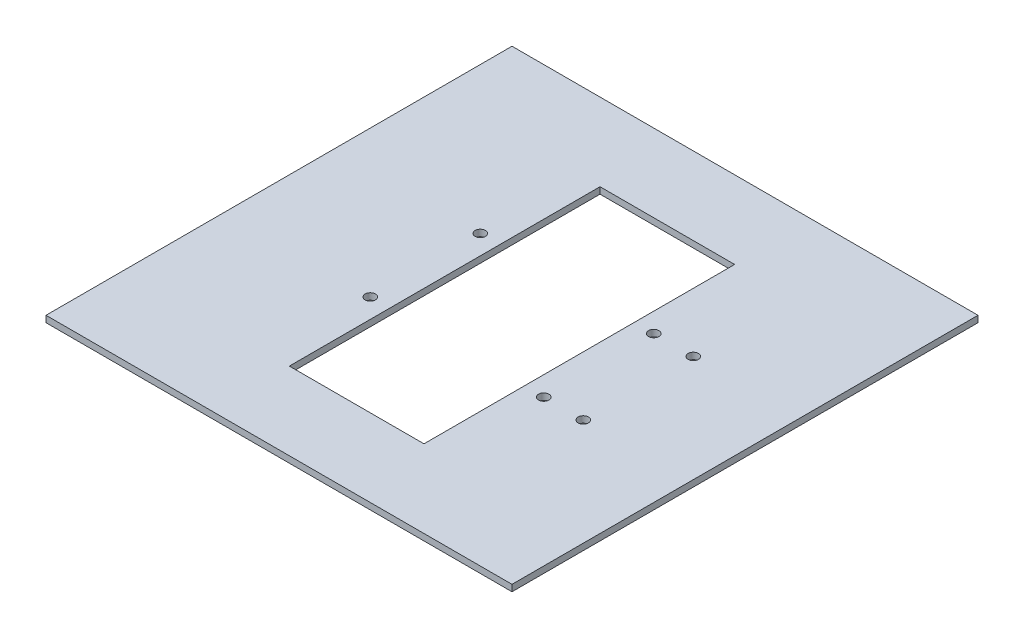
from build123d import *

# Parameters (mm, degrees)
SKETCH1_W           = 228.6
SKETCH1_H           = 228.6
BOSS_EXTRUDE1_DEPTH = 1.5875
SKETCH2_R           = 2.54
SKETCH2_W           = 66.04
SKETCH2_H           = 152.4
CUT_EXTRUDE1_DEPTH  = 162.675788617


with BuildPart() as part:
    # Sketch1 → Boss-Extrude1 (new, symmetric)
    with BuildSketch(Plane(origin=(0, 0, 0), x_dir=(1, 0, 0), z_dir=(0, 1, 0))):
        Rectangle(SKETCH1_W, SKETCH1_H)
    extrude(amount=BOSS_EXTRUDE1_DEPTH, both=True)

    # Sketch2 → Cut-Extrude1 (cut, through all)
    with BuildSketch(Plane(origin=(0, 1.5875, 0), x_dir=(1, 0, 0), z_dir=(0, 1, 0))):
        with Locations(Location((-42.545, 26.9875, 0), (0, 0, 270))):
            Circle(SKETCH2_R)
        with Locations(Location((42.545, 26.9875, 0), (0, 0, 270))):
            Circle(SKETCH2_R)
        with Locations(Location((61.9506, 26.9875, 0), (0, 0, 270))):
            Circle(SKETCH2_R)
        with Locations(Location((61.9506, -26.9875, 0), (0, 0, 270))):
            Circle(SKETCH2_R)
        with Locations(Location((42.545, -26.9875, 0), (0, 0, 270))):
            Circle(SKETCH2_R)
        with Locations(Location((-42.545, -26.9875, 0), (0, 0, 270))):
            Circle(SKETCH2_R)
        Rectangle(SKETCH2_W, SKETCH2_H)
    extrude(amount=-CUT_EXTRUDE1_DEPTH, mode=Mode.SUBTRACT)


solid = part.part
